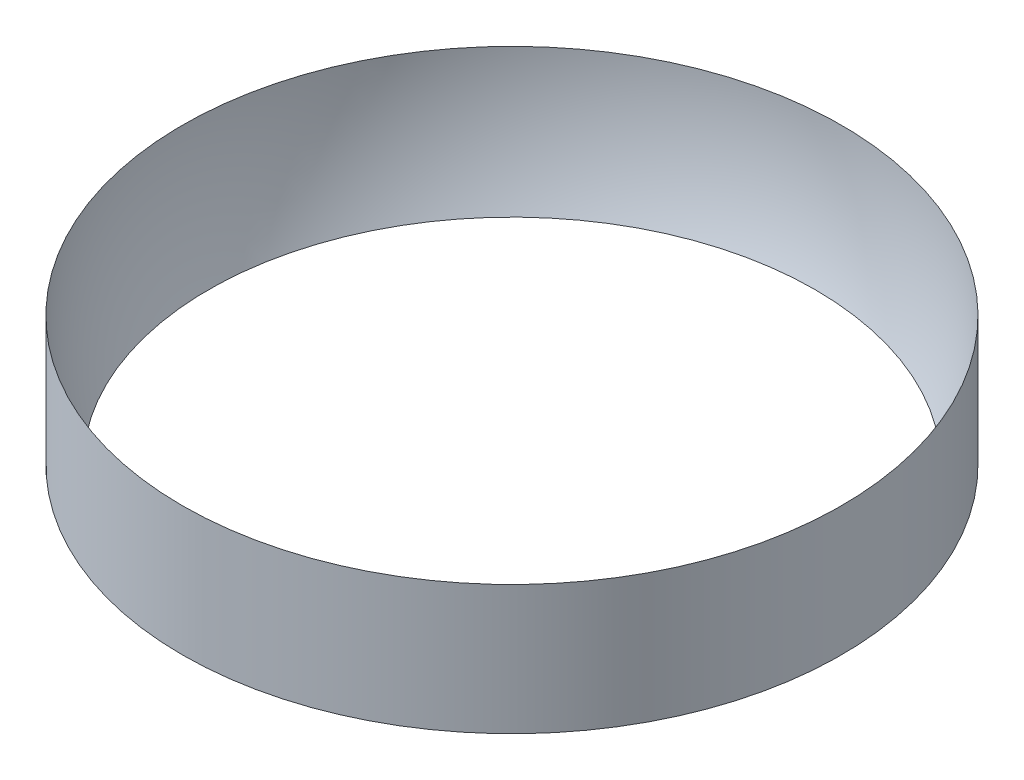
from build123d import *

# Parameters (mm, degrees)
SKETCH1_R           = 6.477
BOSS_EXTRUDE1_DEPTH = 2.54


with BuildPart() as part:
    # Sketch1 → Boss-Extrude1 (new body)
    with BuildSketch(Plane(origin=(0, 0, 0), x_dir=(1, 0, 0), z_dir=(0, 1, 0))):
        with Locations(Location((0, 0, 0), (0, 0, 270))):
            Circle(SKETCH1_R)
    extrude(amount=BOSS_EXTRUDE1_DEPTH)

    # Sketch2 → Cut-Revolve1 (revolve, cut)
    with BuildSketch(Plane(origin=(0, 2.54, 0), x_dir=(1, 0, 0), z_dir=(0, 1, 0))):
        with BuildLine():
            ThreePointArc((0, 6.477), (-6.477, 0), (0, -6.477))
            Line((0, -6.477), (0, 6.477))
        make_face()
        with BuildLine():
            Line((0, 6.477), (0, -6.477))
            ThreePointArc((0, -6.477), (4.579930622, -4.579930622), (6.477, 0))
            ThreePointArc((6.477, 0), (4.579930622, 4.579930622), (0, 6.477))
        make_face()
    revolve(axis=Axis((0, 2.54, 6.477), (0, 0, -1)), mode=Mode.SUBTRACT)


solid = part.part
